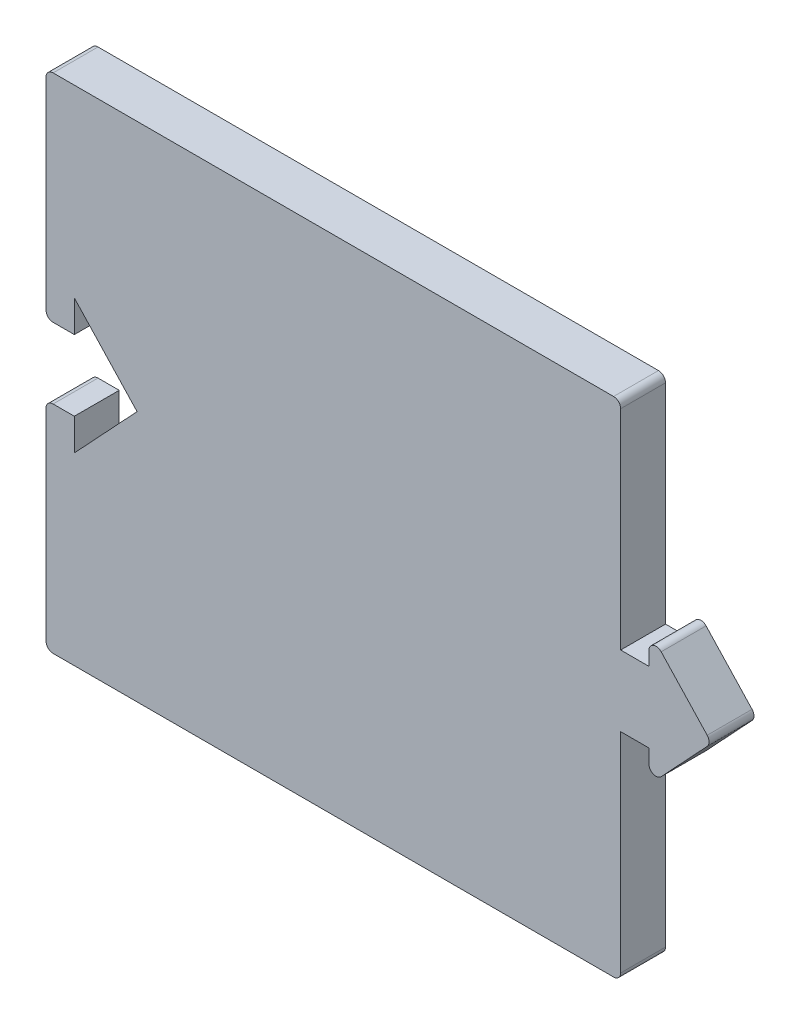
ISO-10303-21;
HEADER;
FILE_DESCRIPTION(('STEP AP214'),'2;1');
FILE_NAME('part.step','',(''),(''),'','','');
FILE_SCHEMA(('AUTOMOTIVE_DESIGN { 1 0 10303 214 1 1 1 1 }'));
ENDSEC;
DATA;
#1=APPLICATION_CONTEXT('core data for automotive mechanical design processes');
#2=APPLICATION_PROTOCOL_DEFINITION('international standard','automotive_design',2000,#1);
#3=PRODUCT_CONTEXT('',#1,'mechanical');
#4=PRODUCT('Part','Part','',(#3));
#5=PRODUCT_RELATED_PRODUCT_CATEGORY('part','',(#4));
#6=PRODUCT_DEFINITION_FORMATION('','',#4);
#7=PRODUCT_DEFINITION_CONTEXT('part definition',#1,'design');
#8=PRODUCT_DEFINITION('design','',#6,#7);
#9=PRODUCT_DEFINITION_SHAPE('','',#8);
#10=(LENGTH_UNIT() NAMED_UNIT(*) SI_UNIT(.MILLI.,.METRE.));
#11=(NAMED_UNIT(*) PLANE_ANGLE_UNIT() SI_UNIT($,.RADIAN.));
#12=(NAMED_UNIT(*) SI_UNIT($,.STERADIAN.) SOLID_ANGLE_UNIT());
#13=UNCERTAINTY_MEASURE_WITH_UNIT(LENGTH_MEASURE(1.E-05),#10,'distance_accuracy_value','');
#14=(GEOMETRIC_REPRESENTATION_CONTEXT(3) GLOBAL_UNCERTAINTY_ASSIGNED_CONTEXT((#13)) GLOBAL_UNIT_ASSIGNED_CONTEXT((#10,
#11,#12)) REPRESENTATION_CONTEXT('',''));
#15=CARTESIAN_POINT('',(0.,0.,0.));
#16=DIRECTION('',(0.,0.,1.));
#17=DIRECTION('',(1.,0.,0.));
#18=AXIS2_PLACEMENT_3D('',#15,#16,#17);
#19=CARTESIAN_POINT('',(0.,15.28,3.175));
#20=DIRECTION('',(1.,0.,0.));
#21=DIRECTION('',(0.,0.,-1.));
#22=AXIS2_PLACEMENT_3D('',#19,#20,#21);
#23=PLANE('',#22);
#24=DIRECTION('',(0.,-1.,0.));
#25=VECTOR('',#24,1.);
#26=CARTESIAN_POINT('',(0.,15.28,0.));
#27=LINE('',#26,#25);
#28=CARTESIAN_POINT('',(0.,14.78,0.));
#29=VERTEX_POINT('',#28);
#30=CARTESIAN_POINT('',(0.,0.5,0.));
#31=VERTEX_POINT('',#30);
#32=EDGE_CURVE('E276',#29,#31,#27,.T.);
#33=ORIENTED_EDGE('',*,*,#32,.T.);
#34=DIRECTION('',(0.,0.,-1.));
#35=VECTOR('',#34,1.);
#36=CARTESIAN_POINT('',(0.,0.5,3.175));
#37=LINE('',#36,#35);
#38=CARTESIAN_POINT('',(0.,0.5,3.175));
#39=VERTEX_POINT('',#38);
#40=EDGE_CURVE('E399',#31,#39,#37,.F.);
#41=ORIENTED_EDGE('',*,*,#40,.T.);
#42=DIRECTION('',(0.,-1.,0.));
#43=VECTOR('',#42,1.);
#44=CARTESIAN_POINT('',(0.,15.28,3.175));
#45=LINE('',#44,#43);
#46=CARTESIAN_POINT('',(0.,14.78,3.175));
#47=VERTEX_POINT('',#46);
#48=EDGE_CURVE('E319',#47,#39,#45,.T.);
#49=ORIENTED_EDGE('',*,*,#48,.F.);
#50=DIRECTION('',(0.,0.,-1.));
#51=VECTOR('',#50,1.);
#52=CARTESIAN_POINT('',(0.,14.78,3.175));
#53=LINE('',#52,#51);
#54=EDGE_CURVE('E396',#47,#29,#53,.T.);
#55=ORIENTED_EDGE('',*,*,#54,.T.);
#56=EDGE_LOOP('',(#33,#41,#49,#55));
#57=FACE_BOUND('',#56,.T.);
#58=ADVANCED_FACE('F33',(#57),#23,.F.);
#59=CARTESIAN_POINT('',(0.,0.,3.175));
#60=DIRECTION('',(0.,1.,0.));
#61=DIRECTION('',(-1.,0.,0.));
#62=AXIS2_PLACEMENT_3D('',#59,#60,#61);
#63=PLANE('',#62);
#64=DIRECTION('',(1.,0.,0.));
#65=VECTOR('',#64,1.);
#66=CARTESIAN_POINT('',(0.,0.,0.));
#67=LINE('',#66,#65);
#68=CARTESIAN_POINT('',(0.5,0.,0.));
#69=VERTEX_POINT('',#68);
#70=CARTESIAN_POINT('',(40.14,0.,0.));
#71=VERTEX_POINT('',#70);
#72=EDGE_CURVE('E279',#69,#71,#67,.T.);
#73=ORIENTED_EDGE('',*,*,#72,.T.);
#74=DIRECTION('',(0.,0.,-1.));
#75=VECTOR('',#74,1.);
#76=CARTESIAN_POINT('',(40.14,0.,3.175));
#77=LINE('',#76,#75);
#78=CARTESIAN_POINT('',(40.14,0.,3.175));
#79=VERTEX_POINT('',#78);
#80=EDGE_CURVE('E394',#71,#79,#77,.F.);
#81=ORIENTED_EDGE('',*,*,#80,.T.);
#82=DIRECTION('',(1.,0.,0.));
#83=VECTOR('',#82,1.);
#84=CARTESIAN_POINT('',(0.,0.,3.175));
#85=LINE('',#84,#83);
#86=CARTESIAN_POINT('',(0.5,0.,3.175));
#87=VERTEX_POINT('',#86);
#88=EDGE_CURVE('E225',#87,#79,#85,.T.);
#89=ORIENTED_EDGE('',*,*,#88,.F.);
#90=DIRECTION('',(0.,0.,-1.));
#91=VECTOR('',#90,1.);
#92=CARTESIAN_POINT('',(0.5,0.,3.175));
#93=LINE('',#92,#91);
#94=EDGE_CURVE('E391',#87,#69,#93,.T.);
#95=ORIENTED_EDGE('',*,*,#94,.T.);
#96=EDGE_LOOP('',(#73,#81,#89,#95));
#97=FACE_BOUND('',#96,.T.);
#98=ADVANCED_FACE('F477',(#97),#63,.F.);
#99=CARTESIAN_POINT('',(40.64,15.28,3.175));
#100=DIRECTION('',(-1.,0.,0.));
#101=DIRECTION('',(0.,-1.,0.));
#102=AXIS2_PLACEMENT_3D('',#99,#100,#101);
#103=PLANE('',#102);
#104=DIRECTION('',(0.,1.,0.));
#105=VECTOR('',#104,1.);
#106=CARTESIAN_POINT('',(40.64,15.28,3.175));
#107=LINE('',#106,#105);
#108=CARTESIAN_POINT('',(40.64,0.499999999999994,3.175));
#109=VERTEX_POINT('',#108);
#110=CARTESIAN_POINT('',(40.64,15.28,3.175));
#111=VERTEX_POINT('',#110);
#112=EDGE_CURVE('E212',#109,#111,#107,.T.);
#113=ORIENTED_EDGE('',*,*,#112,.F.);
#114=DIRECTION('',(0.,0.,-1.));
#115=VECTOR('',#114,1.);
#116=CARTESIAN_POINT('',(40.64,0.499999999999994,3.175));
#117=LINE('',#116,#115);
#118=CARTESIAN_POINT('',(40.64,0.499999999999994,0.));
#119=VERTEX_POINT('',#118);
#120=EDGE_CURVE('E389',#109,#119,#117,.T.);
#121=ORIENTED_EDGE('',*,*,#120,.T.);
#122=DIRECTION('',(0.,1.,0.));
#123=VECTOR('',#122,1.);
#124=CARTESIAN_POINT('',(40.64,15.28,0.));
#125=LINE('',#124,#123);
#126=CARTESIAN_POINT('',(40.64,15.28,0.));
#127=VERTEX_POINT('',#126);
#128=EDGE_CURVE('E231',#119,#127,#125,.T.);
#129=ORIENTED_EDGE('',*,*,#128,.T.);
#130=DIRECTION('',(0.,0.,-1.));
#131=VECTOR('',#130,1.);
#132=CARTESIAN_POINT('',(40.64,15.28,3.175));
#133=LINE('',#132,#131);
#134=EDGE_CURVE('E228',#111,#127,#133,.T.);
#135=ORIENTED_EDGE('',*,*,#134,.F.);
#136=EDGE_LOOP('',(#113,#121,#129,#135));
#137=FACE_BOUND('',#136,.T.);
#138=ADVANCED_FACE('F229',(#137),#103,.F.);
#139=CARTESIAN_POINT('',(40.64,15.28,3.175));
#140=DIRECTION('',(0.,1.,0.));
#141=DIRECTION('',(0.,0.,1.));
#142=AXIS2_PLACEMENT_3D('',#139,#140,#141);
#143=PLANE('',#142);
#144=DIRECTION('',(1.,0.,0.));
#145=VECTOR('',#144,1.);
#146=CARTESIAN_POINT('',(40.64,15.28,0.));
#147=LINE('',#146,#145);
#148=CARTESIAN_POINT('',(42.64,15.28,0.));
#149=VERTEX_POINT('',#148);
#150=EDGE_CURVE('E283',#127,#149,#147,.T.);
#151=ORIENTED_EDGE('',*,*,#150,.T.);
#152=DIRECTION('',(0.,0.,-1.));
#153=VECTOR('',#152,1.);
#154=CARTESIAN_POINT('',(42.64,15.28,3.175));
#155=LINE('',#154,#153);
#156=CARTESIAN_POINT('',(42.64,15.28,3.175));
#157=VERTEX_POINT('',#156);
#158=EDGE_CURVE('E235',#157,#149,#155,.T.);
#159=ORIENTED_EDGE('',*,*,#158,.F.);
#160=DIRECTION('',(1.,0.,0.));
#161=VECTOR('',#160,1.);
#162=CARTESIAN_POINT('',(40.64,15.28,3.175));
#163=LINE('',#162,#161);
#164=EDGE_CURVE('E217',#111,#157,#163,.T.);
#165=ORIENTED_EDGE('',*,*,#164,.F.);
#166=ORIENTED_EDGE('',*,*,#134,.T.);
#167=EDGE_LOOP('',(#151,#159,#165,#166));
#168=FACE_BOUND('',#167,.T.);
#169=ADVANCED_FACE('F237',(#168),#143,.F.);
#170=CARTESIAN_POINT('',(42.64,15.28,3.175));
#171=DIRECTION('',(1.,0.,0.));
#172=DIRECTION('',(0.,0.,-1.));
#173=AXIS2_PLACEMENT_3D('',#170,#171,#172);
#174=PLANE('',#173);
#175=DIRECTION('',(0.,-1.,0.));
#176=VECTOR('',#175,1.);
#177=CARTESIAN_POINT('',(42.64,15.28,0.));
#178=LINE('',#177,#176);
#179=CARTESIAN_POINT('',(42.64,14.2977313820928,0.));
#180=VERTEX_POINT('',#179);
#181=EDGE_CURVE('E285',#149,#180,#178,.T.);
#182=ORIENTED_EDGE('',*,*,#181,.T.);
#183=DIRECTION('',(0.,0.,-1.));
#184=VECTOR('',#183,1.);
#185=CARTESIAN_POINT('',(42.64,14.2977313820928,3.175));
#186=LINE('',#185,#184);
#187=CARTESIAN_POINT('',(42.64,14.2977313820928,3.175));
#188=VERTEX_POINT('',#187);
#189=EDGE_CURVE('E363',#180,#188,#186,.F.);
#190=ORIENTED_EDGE('',*,*,#189,.T.);
#191=DIRECTION('',(0.,-1.,0.));
#192=VECTOR('',#191,1.);
#193=CARTESIAN_POINT('',(42.64,15.28,3.175));
#194=LINE('',#193,#192);
#195=EDGE_CURVE('E240',#157,#188,#194,.T.);
#196=ORIENTED_EDGE('',*,*,#195,.F.);
#197=ORIENTED_EDGE('',*,*,#158,.T.);
#198=EDGE_LOOP('',(#182,#190,#196,#197));
#199=FACE_BOUND('',#198,.T.);
#200=ADVANCED_FACE('F484',(#199),#174,.F.);
#201=CARTESIAN_POINT('',(42.64,13.03,3.175));
#202=DIRECTION('',(-0.73076923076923,0.682624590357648,0.));
#203=DIRECTION('',(-0.682624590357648,-0.730769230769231,0.));
#204=AXIS2_PLACEMENT_3D('',#201,#202,#203);
#205=PLANE('',#204);
#206=DIRECTION('',(0.682624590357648,0.73076923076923,0.));
#207=VECTOR('',#206,1.);
#208=CARTESIAN_POINT('',(42.64,13.03,3.175));
#209=LINE('',#208,#207);
#210=CARTESIAN_POINT('',(43.5053846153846,13.956419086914,3.175));
#211=VERTEX_POINT('',#210);
#212=CARTESIAN_POINT('',(46.7582339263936,17.4386877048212,3.175));
#213=VERTEX_POINT('',#212);
#214=EDGE_CURVE('E242',#211,#213,#209,.T.);
#215=ORIENTED_EDGE('',*,*,#214,.F.);
#216=DIRECTION('',(0.,0.,-1.));
#217=VECTOR('',#216,1.);
#218=CARTESIAN_POINT('',(43.5053846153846,13.956419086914,3.175));
#219=LINE('',#218,#217);
#220=CARTESIAN_POINT('',(43.5053846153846,13.956419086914,0.));
#221=VERTEX_POINT('',#220);
#222=EDGE_CURVE('E342',#211,#221,#219,.T.);
#223=ORIENTED_EDGE('',*,*,#222,.T.);
#224=DIRECTION('',(0.682624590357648,0.73076923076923,0.));
#225=VECTOR('',#224,1.);
#226=CARTESIAN_POINT('',(42.64,13.03,0.));
#227=LINE('',#226,#225);
#228=CARTESIAN_POINT('',(46.7582339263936,17.4386877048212,0.));
#229=VERTEX_POINT('',#228);
#230=EDGE_CURVE('E288',#221,#229,#227,.T.);
#231=ORIENTED_EDGE('',*,*,#230,.T.);
#232=DIRECTION('',(0.,0.,-1.));
#233=VECTOR('',#232,1.);
#234=CARTESIAN_POINT('',(46.7582339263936,17.4386877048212,3.175));
#235=LINE('',#234,#233);
#236=EDGE_CURVE('E234',#229,#213,#235,.F.);
#237=ORIENTED_EDGE('',*,*,#236,.T.);
#238=EDGE_LOOP('',(#215,#223,#231,#237));
#239=FACE_BOUND('',#238,.T.);
#240=ADVANCED_FACE('F492',(#239),#205,.F.);
#241=CARTESIAN_POINT('',(42.64,22.53,3.175));
#242=DIRECTION('',(-0.73076923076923,-0.682624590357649,0.));
#243=DIRECTION('',(0.682624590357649,-0.73076923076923,0.));
#244=AXIS2_PLACEMENT_3D('',#241,#242,#243);
#245=PLANE('',#244);
#246=DIRECTION('',(-0.682624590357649,0.73076923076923,0.));
#247=VECTOR('',#246,1.);
#248=CARTESIAN_POINT('',(42.64,22.53,0.));
#249=LINE('',#248,#247);
#250=CARTESIAN_POINT('',(46.7582339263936,18.1213122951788,0.));
#251=VERTEX_POINT('',#250);
#252=CARTESIAN_POINT('',(43.5053846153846,21.603580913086,0.));
#253=VERTEX_POINT('',#252);
#254=EDGE_CURVE('E291',#251,#253,#249,.T.);
#255=ORIENTED_EDGE('',*,*,#254,.T.);
#256=DIRECTION('',(0.,0.,-1.));
#257=VECTOR('',#256,1.);
#258=CARTESIAN_POINT('',(43.5053846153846,21.603580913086,3.175));
#259=LINE('',#258,#257);
#260=CARTESIAN_POINT('',(43.5053846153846,21.603580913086,3.175));
#261=VERTEX_POINT('',#260);
#262=EDGE_CURVE('E387',#253,#261,#259,.F.);
#263=ORIENTED_EDGE('',*,*,#262,.T.);
#264=DIRECTION('',(-0.682624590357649,0.73076923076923,0.));
#265=VECTOR('',#264,1.);
#266=CARTESIAN_POINT('',(42.64,22.53,3.175));
#267=LINE('',#266,#265);
#268=CARTESIAN_POINT('',(46.7582339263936,18.1213122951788,3.175));
#269=VERTEX_POINT('',#268);
#270=EDGE_CURVE('E248',#269,#261,#267,.T.);
#271=ORIENTED_EDGE('',*,*,#270,.F.);
#272=DIRECTION('',(0.,0.,-1.));
#273=VECTOR('',#272,1.);
#274=CARTESIAN_POINT('',(46.7582339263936,18.1213122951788,3.175));
#275=LINE('',#274,#273);
#276=EDGE_CURVE('E384',#269,#251,#275,.T.);
#277=ORIENTED_EDGE('',*,*,#276,.T.);
#278=EDGE_LOOP('',(#255,#263,#271,#277));
#279=FACE_BOUND('',#278,.T.);
#280=ADVANCED_FACE('F501',(#279),#245,.F.);
#281=CARTESIAN_POINT('',(42.64,20.28,3.175));
#282=DIRECTION('',(1.,0.,0.));
#283=DIRECTION('',(0.,0.,-1.));
#284=AXIS2_PLACEMENT_3D('',#281,#282,#283);
#285=PLANE('',#284);
#286=DIRECTION('',(0.,-1.,0.));
#287=VECTOR('',#286,1.);
#288=CARTESIAN_POINT('',(42.64,20.28,3.175));
#289=LINE('',#288,#287);
#290=CARTESIAN_POINT('',(42.64,21.2622686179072,3.175));
#291=VERTEX_POINT('',#290);
#292=CARTESIAN_POINT('',(42.64,20.28,3.175));
#293=VERTEX_POINT('',#292);
#294=EDGE_CURVE('E251',#291,#293,#289,.T.);
#295=ORIENTED_EDGE('',*,*,#294,.F.);
#296=DIRECTION('',(0.,0.,-1.));
#297=VECTOR('',#296,1.);
#298=CARTESIAN_POINT('',(42.64,21.2622686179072,3.175));
#299=LINE('',#298,#297);
#300=CARTESIAN_POINT('',(42.64,21.2622686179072,0.));
#301=VERTEX_POINT('',#300);
#302=EDGE_CURVE('E381',#291,#301,#299,.T.);
#303=ORIENTED_EDGE('',*,*,#302,.T.);
#304=DIRECTION('',(0.,-1.,0.));
#305=VECTOR('',#304,1.);
#306=CARTESIAN_POINT('',(42.64,20.28,0.));
#307=LINE('',#306,#305);
#308=CARTESIAN_POINT('',(42.64,20.28,0.));
#309=VERTEX_POINT('',#308);
#310=EDGE_CURVE('E294',#301,#309,#307,.T.);
#311=ORIENTED_EDGE('',*,*,#310,.T.);
#312=DIRECTION('',(0.,0.,-1.));
#313=VECTOR('',#312,1.);
#314=CARTESIAN_POINT('',(42.64,20.28,3.175));
#315=LINE('',#314,#313);
#316=EDGE_CURVE('E337',#293,#309,#315,.T.);
#317=ORIENTED_EDGE('',*,*,#316,.F.);
#318=EDGE_LOOP('',(#295,#303,#311,#317));
#319=FACE_BOUND('',#318,.T.);
#320=ADVANCED_FACE('F510',(#319),#285,.F.);
#321=CARTESIAN_POINT('',(40.64,20.28,3.175));
#322=DIRECTION('',(0.,-1.,0.));
#323=DIRECTION('',(0.,0.,-1.));
#324=AXIS2_PLACEMENT_3D('',#321,#322,#323);
#325=PLANE('',#324);
#326=DIRECTION('',(-1.,0.,0.));
#327=VECTOR('',#326,1.);
#328=CARTESIAN_POINT('',(40.64,20.28,0.));
#329=LINE('',#328,#327);
#330=CARTESIAN_POINT('',(40.64,20.28,0.));
#331=VERTEX_POINT('',#330);
#332=EDGE_CURVE('E296',#309,#331,#329,.T.);
#333=ORIENTED_EDGE('',*,*,#332,.T.);
#334=DIRECTION('',(0.,0.,-1.));
#335=VECTOR('',#334,1.);
#336=CARTESIAN_POINT('',(40.64,20.28,3.175));
#337=LINE('',#336,#335);
#338=CARTESIAN_POINT('',(40.64,20.28,3.175));
#339=VERTEX_POINT('',#338);
#340=EDGE_CURVE('E334',#339,#331,#337,.T.);
#341=ORIENTED_EDGE('',*,*,#340,.F.);
#342=DIRECTION('',(-1.,0.,0.));
#343=VECTOR('',#342,1.);
#344=CARTESIAN_POINT('',(40.64,20.28,3.175));
#345=LINE('',#344,#343);
#346=EDGE_CURVE('E253',#293,#339,#345,.T.);
#347=ORIENTED_EDGE('',*,*,#346,.F.);
#348=ORIENTED_EDGE('',*,*,#316,.T.);
#349=EDGE_LOOP('',(#333,#341,#347,#348));
#350=FACE_BOUND('',#349,.T.);
#351=ADVANCED_FACE('F515',(#350),#325,.F.);
#352=CARTESIAN_POINT('',(40.64,35.56,3.175));
#353=DIRECTION('',(-1.,0.,0.));
#354=DIRECTION('',(0.,-1.,0.));
#355=AXIS2_PLACEMENT_3D('',#352,#353,#354);
#356=PLANE('',#355);
#357=DIRECTION('',(0.,1.,0.));
#358=VECTOR('',#357,1.);
#359=CARTESIAN_POINT('',(40.64,35.56,0.));
#360=LINE('',#359,#358);
#361=CARTESIAN_POINT('',(40.64,35.06,0.));
#362=VERTEX_POINT('',#361);
#363=EDGE_CURVE('E298',#331,#362,#360,.T.);
#364=ORIENTED_EDGE('',*,*,#363,.T.);
#365=DIRECTION('',(0.,0.,-1.));
#366=VECTOR('',#365,1.);
#367=CARTESIAN_POINT('',(40.64,35.06,3.175));
#368=LINE('',#367,#366);
#369=CARTESIAN_POINT('',(40.64,35.06,3.175));
#370=VERTEX_POINT('',#369);
#371=EDGE_CURVE('E11',#362,#370,#368,.F.);
#372=ORIENTED_EDGE('',*,*,#371,.T.);
#373=DIRECTION('',(0.,1.,0.));
#374=VECTOR('',#373,1.);
#375=CARTESIAN_POINT('',(40.64,35.56,3.175));
#376=LINE('',#375,#374);
#377=EDGE_CURVE('E255',#339,#370,#376,.T.);
#378=ORIENTED_EDGE('',*,*,#377,.F.);
#379=ORIENTED_EDGE('',*,*,#340,.T.);
#380=EDGE_LOOP('',(#364,#372,#378,#379));
#381=FACE_BOUND('',#380,.T.);
#382=ADVANCED_FACE('F519',(#381),#356,.F.);
#383=CARTESIAN_POINT('',(0.,35.56,3.175));
#384=DIRECTION('',(0.,-1.,0.));
#385=DIRECTION('',(1.,0.,0.));
#386=AXIS2_PLACEMENT_3D('',#383,#384,#385);
#387=PLANE('',#386);
#388=DIRECTION('',(-1.,0.,0.));
#389=VECTOR('',#388,1.);
#390=CARTESIAN_POINT('',(0.,35.56,3.175));
#391=LINE('',#390,#389);
#392=CARTESIAN_POINT('',(40.14,35.56,3.175));
#393=VERTEX_POINT('',#392);
#394=CARTESIAN_POINT('',(0.5,35.56,3.175));
#395=VERTEX_POINT('',#394);
#396=EDGE_CURVE('E258',#393,#395,#391,.T.);
#397=ORIENTED_EDGE('',*,*,#396,.F.);
#398=DIRECTION('',(0.,0.,-1.));
#399=VECTOR('',#398,1.);
#400=CARTESIAN_POINT('',(40.14,35.56,3.175));
#401=LINE('',#400,#399);
#402=CARTESIAN_POINT('',(40.14,35.56,0.));
#403=VERTEX_POINT('',#402);
#404=EDGE_CURVE('E41',#393,#403,#401,.T.);
#405=ORIENTED_EDGE('',*,*,#404,.T.);
#406=DIRECTION('',(-1.,0.,0.));
#407=VECTOR('',#406,1.);
#408=CARTESIAN_POINT('',(0.,35.56,0.));
#409=LINE('',#408,#407);
#410=CARTESIAN_POINT('',(0.5,35.56,0.));
#411=VERTEX_POINT('',#410);
#412=EDGE_CURVE('E301',#403,#411,#409,.T.);
#413=ORIENTED_EDGE('',*,*,#412,.T.);
#414=DIRECTION('',(0.,0.,-1.));
#415=VECTOR('',#414,1.);
#416=CARTESIAN_POINT('',(0.5,35.56,3.175));
#417=LINE('',#416,#415);
#418=EDGE_CURVE('E410',#411,#395,#417,.F.);
#419=ORIENTED_EDGE('',*,*,#418,.T.);
#420=EDGE_LOOP('',(#397,#405,#413,#419));
#421=FACE_BOUND('',#420,.T.);
#422=ADVANCED_FACE('F416',(#421),#387,.F.);
#423=CARTESIAN_POINT('',(0.,35.56,3.175));
#424=DIRECTION('',(1.,0.,0.));
#425=DIRECTION('',(0.,0.,-1.));
#426=AXIS2_PLACEMENT_3D('',#423,#424,#425);
#427=PLANE('',#426);
#428=DIRECTION('',(0.,-1.,0.));
#429=VECTOR('',#428,1.);
#430=CARTESIAN_POINT('',(0.,35.56,0.));
#431=LINE('',#430,#429);
#432=CARTESIAN_POINT('',(0.,35.06,0.));
#433=VERTEX_POINT('',#432);
#434=CARTESIAN_POINT('',(0.,20.78,0.));
#435=VERTEX_POINT('',#434);
#436=EDGE_CURVE('E304',#433,#435,#431,.T.);
#437=ORIENTED_EDGE('',*,*,#436,.T.);
#438=DIRECTION('',(0.,0.,-1.));
#439=VECTOR('',#438,1.);
#440=CARTESIAN_POINT('',(0.,20.78,3.175));
#441=LINE('',#440,#439);
#442=CARTESIAN_POINT('',(0.,20.78,3.175));
#443=VERTEX_POINT('',#442);
#444=EDGE_CURVE('E408',#435,#443,#441,.F.);
#445=ORIENTED_EDGE('',*,*,#444,.T.);
#446=DIRECTION('',(0.,-1.,0.));
#447=VECTOR('',#446,1.);
#448=CARTESIAN_POINT('',(0.,35.56,3.175));
#449=LINE('',#448,#447);
#450=CARTESIAN_POINT('',(0.,35.06,3.175));
#451=VERTEX_POINT('',#450);
#452=EDGE_CURVE('E261',#451,#443,#449,.T.);
#453=ORIENTED_EDGE('',*,*,#452,.F.);
#454=DIRECTION('',(0.,0.,-1.));
#455=VECTOR('',#454,1.);
#456=CARTESIAN_POINT('',(0.,35.06,3.175));
#457=LINE('',#456,#455);
#458=EDGE_CURVE('E405',#451,#433,#457,.T.);
#459=ORIENTED_EDGE('',*,*,#458,.T.);
#460=EDGE_LOOP('',(#437,#445,#453,#459));
#461=FACE_BOUND('',#460,.T.);
#462=ADVANCED_FACE('F430',(#461),#427,.F.);
#463=CARTESIAN_POINT('',(0.,20.28,3.175));
#464=DIRECTION('',(0.,1.,0.));
#465=DIRECTION('',(-1.,0.,0.));
#466=AXIS2_PLACEMENT_3D('',#463,#464,#465);
#467=PLANE('',#466);
#468=DIRECTION('',(1.,0.,0.));
#469=VECTOR('',#468,1.);
#470=CARTESIAN_POINT('',(0.,20.28,3.175));
#471=LINE('',#470,#469);
#472=CARTESIAN_POINT('',(0.500000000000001,20.28,3.175));
#473=VERTEX_POINT('',#472);
#474=CARTESIAN_POINT('',(2.,20.28,3.175));
#475=VERTEX_POINT('',#474);
#476=EDGE_CURVE('E263',#473,#475,#471,.T.);
#477=ORIENTED_EDGE('',*,*,#476,.F.);
#478=DIRECTION('',(0.,0.,-1.));
#479=VECTOR('',#478,1.);
#480=CARTESIAN_POINT('',(0.500000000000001,20.28,3.175));
#481=LINE('',#480,#479);
#482=CARTESIAN_POINT('',(0.500000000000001,20.28,0.));
#483=VERTEX_POINT('',#482);
#484=EDGE_CURVE('E402',#473,#483,#481,.T.);
#485=ORIENTED_EDGE('',*,*,#484,.T.);
#486=DIRECTION('',(1.,0.,0.));
#487=VECTOR('',#486,1.);
#488=CARTESIAN_POINT('',(0.,20.28,0.));
#489=LINE('',#488,#487);
#490=CARTESIAN_POINT('',(2.,20.28,0.));
#491=VERTEX_POINT('',#490);
#492=EDGE_CURVE('E307',#483,#491,#489,.T.);
#493=ORIENTED_EDGE('',*,*,#492,.T.);
#494=DIRECTION('',(0.,0.,-1.));
#495=VECTOR('',#494,1.);
#496=CARTESIAN_POINT('',(2.,20.28,3.175));
#497=LINE('',#496,#495);
#498=EDGE_CURVE('E331',#475,#491,#497,.T.);
#499=ORIENTED_EDGE('',*,*,#498,.F.);
#500=EDGE_LOOP('',(#477,#485,#493,#499));
#501=FACE_BOUND('',#500,.T.);
#502=ADVANCED_FACE('F437',(#501),#467,.F.);
#503=CARTESIAN_POINT('',(2.,20.28,3.175));
#504=DIRECTION('',(-1.,0.,0.));
#505=DIRECTION('',(0.,0.,1.));
#506=AXIS2_PLACEMENT_3D('',#503,#504,#505);
#507=PLANE('',#506);
#508=DIRECTION('',(0.,1.,0.));
#509=VECTOR('',#508,1.);
#510=CARTESIAN_POINT('',(2.,20.28,0.));
#511=LINE('',#510,#509);
#512=CARTESIAN_POINT('',(2.,22.53,0.));
#513=VERTEX_POINT('',#512);
#514=EDGE_CURVE('E309',#491,#513,#511,.T.);
#515=ORIENTED_EDGE('',*,*,#514,.T.);
#516=DIRECTION('',(0.,0.,-1.));
#517=VECTOR('',#516,1.);
#518=CARTESIAN_POINT('',(2.,22.53,3.175));
#519=LINE('',#518,#517);
#520=CARTESIAN_POINT('',(2.,22.53,3.175));
#521=VERTEX_POINT('',#520);
#522=EDGE_CURVE('E328',#521,#513,#519,.T.);
#523=ORIENTED_EDGE('',*,*,#522,.F.);
#524=DIRECTION('',(0.,1.,0.));
#525=VECTOR('',#524,1.);
#526=CARTESIAN_POINT('',(2.,20.28,3.175));
#527=LINE('',#526,#525);
#528=EDGE_CURVE('E265',#475,#521,#527,.T.);
#529=ORIENTED_EDGE('',*,*,#528,.F.);
#530=ORIENTED_EDGE('',*,*,#498,.T.);
#531=EDGE_LOOP('',(#515,#523,#529,#530));
#532=FACE_BOUND('',#531,.T.);
#533=ADVANCED_FACE('F444',(#532),#507,.F.);
#534=CARTESIAN_POINT('',(2.,22.53,3.175));
#535=DIRECTION('',(0.730769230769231,0.682624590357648,0.));
#536=DIRECTION('',(-0.682624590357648,0.730769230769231,0.));
#537=AXIS2_PLACEMENT_3D('',#534,#535,#536);
#538=PLANE('',#537);
#539=DIRECTION('',(0.682624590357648,-0.730769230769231,0.));
#540=VECTOR('',#539,1.);
#541=CARTESIAN_POINT('',(2.,22.53,0.));
#542=LINE('',#541,#540);
#543=CARTESIAN_POINT('',(6.43705983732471,17.78,0.));
#544=VERTEX_POINT('',#543);
#545=EDGE_CURVE('E311',#513,#544,#542,.T.);
#546=ORIENTED_EDGE('',*,*,#545,.T.);
#547=DIRECTION('',(0.,0.,-1.));
#548=VECTOR('',#547,1.);
#549=CARTESIAN_POINT('',(6.43705983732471,17.78,3.175));
#550=LINE('',#549,#548);
#551=CARTESIAN_POINT('',(6.43705983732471,17.78,3.175));
#552=VERTEX_POINT('',#551);
#553=EDGE_CURVE('E325',#552,#544,#550,.T.);
#554=ORIENTED_EDGE('',*,*,#553,.F.);
#555=DIRECTION('',(0.682624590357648,-0.730769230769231,0.));
#556=VECTOR('',#555,1.);
#557=CARTESIAN_POINT('',(2.,22.53,3.175));
#558=LINE('',#557,#556);
#559=EDGE_CURVE('E267',#521,#552,#558,.T.);
#560=ORIENTED_EDGE('',*,*,#559,.F.);
#561=ORIENTED_EDGE('',*,*,#522,.T.);
#562=EDGE_LOOP('',(#546,#554,#560,#561));
#563=FACE_BOUND('',#562,.T.);
#564=ADVANCED_FACE('F448',(#563),#538,.F.);
#565=CARTESIAN_POINT('',(2.,13.03,3.175));
#566=DIRECTION('',(0.730769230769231,-0.682624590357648,0.));
#567=DIRECTION('',(0.682624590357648,0.730769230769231,0.));
#568=AXIS2_PLACEMENT_3D('',#565,#566,#567);
#569=PLANE('',#568);
#570=DIRECTION('',(-0.682624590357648,-0.730769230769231,0.));
#571=VECTOR('',#570,1.);
#572=CARTESIAN_POINT('',(2.,13.03,0.));
#573=LINE('',#572,#571);
#574=CARTESIAN_POINT('',(2.,13.03,0.));
#575=VERTEX_POINT('',#574);
#576=EDGE_CURVE('E313',#544,#575,#573,.T.);
#577=ORIENTED_EDGE('',*,*,#576,.T.);
#578=DIRECTION('',(0.,0.,-1.));
#579=VECTOR('',#578,1.);
#580=CARTESIAN_POINT('',(2.,13.03,3.175));
#581=LINE('',#580,#579);
#582=CARTESIAN_POINT('',(2.,13.03,3.175));
#583=VERTEX_POINT('',#582);
#584=EDGE_CURVE('E322',#583,#575,#581,.T.);
#585=ORIENTED_EDGE('',*,*,#584,.F.);
#586=DIRECTION('',(-0.682624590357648,-0.730769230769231,0.));
#587=VECTOR('',#586,1.);
#588=CARTESIAN_POINT('',(2.,13.03,3.175));
#589=LINE('',#588,#587);
#590=EDGE_CURVE('E269',#552,#583,#589,.T.);
#591=ORIENTED_EDGE('',*,*,#590,.F.);
#592=ORIENTED_EDGE('',*,*,#553,.T.);
#593=EDGE_LOOP('',(#577,#585,#591,#592));
#594=FACE_BOUND('',#593,.T.);
#595=ADVANCED_FACE('F455',(#594),#569,.F.);
#596=CARTESIAN_POINT('',(2.,15.28,3.175));
#597=DIRECTION('',(-1.,0.,0.));
#598=DIRECTION('',(0.,0.,1.));
#599=AXIS2_PLACEMENT_3D('',#596,#597,#598);
#600=PLANE('',#599);
#601=DIRECTION('',(0.,1.,0.));
#602=VECTOR('',#601,1.);
#603=CARTESIAN_POINT('',(2.,15.28,0.));
#604=LINE('',#603,#602);
#605=CARTESIAN_POINT('',(2.,15.28,0.));
#606=VERTEX_POINT('',#605);
#607=EDGE_CURVE('E315',#575,#606,#604,.T.);
#608=ORIENTED_EDGE('',*,*,#607,.T.);
#609=DIRECTION('',(0.,0.,-1.));
#610=VECTOR('',#609,1.);
#611=CARTESIAN_POINT('',(2.,15.28,3.175));
#612=LINE('',#611,#610);
#613=CARTESIAN_POINT('',(2.,15.28,3.175));
#614=VERTEX_POINT('',#613);
#615=EDGE_CURVE('E275',#614,#606,#612,.T.);
#616=ORIENTED_EDGE('',*,*,#615,.F.);
#617=DIRECTION('',(0.,1.,0.));
#618=VECTOR('',#617,1.);
#619=CARTESIAN_POINT('',(2.,15.28,3.175));
#620=LINE('',#619,#618);
#621=EDGE_CURVE('E271',#583,#614,#620,.T.);
#622=ORIENTED_EDGE('',*,*,#621,.F.);
#623=ORIENTED_EDGE('',*,*,#584,.T.);
#624=EDGE_LOOP('',(#608,#616,#622,#623));
#625=FACE_BOUND('',#624,.T.);
#626=ADVANCED_FACE('F458',(#625),#600,.F.);
#627=CARTESIAN_POINT('',(0.,15.28,3.175));
#628=DIRECTION('',(0.,-1.,0.));
#629=DIRECTION('',(1.,0.,0.));
#630=AXIS2_PLACEMENT_3D('',#627,#628,#629);
#631=PLANE('',#630);
#632=DIRECTION('',(-1.,0.,0.));
#633=VECTOR('',#632,1.);
#634=CARTESIAN_POINT('',(0.,15.28,0.));
#635=LINE('',#634,#633);
#636=CARTESIAN_POINT('',(0.500000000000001,15.28,0.));
#637=VERTEX_POINT('',#636);
#638=EDGE_CURVE('E317',#606,#637,#635,.T.);
#639=ORIENTED_EDGE('',*,*,#638,.T.);
#640=DIRECTION('',(0.,0.,-1.));
#641=VECTOR('',#640,1.);
#642=CARTESIAN_POINT('',(0.500000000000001,15.28,3.175));
#643=LINE('',#642,#641);
#644=CARTESIAN_POINT('',(0.500000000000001,15.28,3.175));
#645=VERTEX_POINT('',#644);
#646=EDGE_CURVE('E48',#637,#645,#643,.F.);
#647=ORIENTED_EDGE('',*,*,#646,.T.);
#648=DIRECTION('',(-1.,0.,0.));
#649=VECTOR('',#648,1.);
#650=CARTESIAN_POINT('',(0.,15.28,3.175));
#651=LINE('',#650,#649);
#652=EDGE_CURVE('E273',#614,#645,#651,.T.);
#653=ORIENTED_EDGE('',*,*,#652,.F.);
#654=ORIENTED_EDGE('',*,*,#615,.T.);
#655=EDGE_LOOP('',(#639,#647,#653,#654));
#656=FACE_BOUND('',#655,.T.);
#657=ADVANCED_FACE('F460',(#656),#631,.F.);
#658=CARTESIAN_POINT('',(0.,0.,3.175));
#659=DIRECTION('',(0.,0.,1.));
#660=DIRECTION('',(1.,0.,0.));
#661=AXIS2_PLACEMENT_3D('',#658,#659,#660);
#662=PLANE('',#661);
#663=ORIENTED_EDGE('',*,*,#195,.T.);
#664=CARTESIAN_POINT('',(43.14,14.2977313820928,3.175));
#665=DIRECTION('',(0.,0.,1.));
#666=DIRECTION('',(1.,0.,0.));
#667=AXIS2_PLACEMENT_3D('',#664,#665,#666);
#668=CIRCLE('',#667,0.5);
#669=EDGE_CURVE('E379',#188,#211,#668,.T.);
#670=ORIENTED_EDGE('',*,*,#669,.T.);
#671=ORIENTED_EDGE('',*,*,#214,.T.);
#672=CARTESIAN_POINT('',(46.3928493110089,17.78,3.175));
#673=DIRECTION('',(0.,0.,1.));
#674=DIRECTION('',(1.,0.,0.));
#675=AXIS2_PLACEMENT_3D('',#672,#673,#674);
#676=CIRCLE('',#675,0.5);
#677=EDGE_CURVE('E375',#213,#269,#676,.T.);
#678=ORIENTED_EDGE('',*,*,#677,.T.);
#679=ORIENTED_EDGE('',*,*,#270,.T.);
#680=CARTESIAN_POINT('',(43.14,21.2622686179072,3.175));
#681=DIRECTION('',(0.,0.,1.));
#682=DIRECTION('',(1.,0.,0.));
#683=AXIS2_PLACEMENT_3D('',#680,#681,#682);
#684=CIRCLE('',#683,0.5);
#685=EDGE_CURVE('E377',#261,#291,#684,.T.);
#686=ORIENTED_EDGE('',*,*,#685,.T.);
#687=ORIENTED_EDGE('',*,*,#294,.T.);
#688=ORIENTED_EDGE('',*,*,#346,.T.);
#689=ORIENTED_EDGE('',*,*,#377,.T.);
#690=CARTESIAN_POINT('',(40.14,35.06,3.175));
#691=DIRECTION('',(0.,0.,1.));
#692=DIRECTION('',(1.,0.,0.));
#693=AXIS2_PLACEMENT_3D('',#690,#691,#692);
#694=CIRCLE('',#693,0.5);
#695=EDGE_CURVE('E367',#370,#393,#694,.T.);
#696=ORIENTED_EDGE('',*,*,#695,.T.);
#697=ORIENTED_EDGE('',*,*,#396,.T.);
#698=CARTESIAN_POINT('',(0.5,35.06,3.175));
#699=DIRECTION('',(0.,0.,1.));
#700=DIRECTION('',(1.,0.,0.));
#701=AXIS2_PLACEMENT_3D('',#698,#699,#700);
#702=CIRCLE('',#701,0.5);
#703=EDGE_CURVE('E365',#395,#451,#702,.T.);
#704=ORIENTED_EDGE('',*,*,#703,.T.);
#705=ORIENTED_EDGE('',*,*,#452,.T.);
#706=CARTESIAN_POINT('',(0.5,20.78,3.175));
#707=DIRECTION('',(0.,0.,1.));
#708=DIRECTION('',(1.,0.,0.));
#709=AXIS2_PLACEMENT_3D('',#706,#707,#708);
#710=CIRCLE('',#709,0.5);
#711=EDGE_CURVE('E56',#443,#473,#710,.T.);
#712=ORIENTED_EDGE('',*,*,#711,.T.);
#713=ORIENTED_EDGE('',*,*,#476,.T.);
#714=ORIENTED_EDGE('',*,*,#528,.T.);
#715=ORIENTED_EDGE('',*,*,#559,.T.);
#716=ORIENTED_EDGE('',*,*,#590,.T.);
#717=ORIENTED_EDGE('',*,*,#621,.T.);
#718=ORIENTED_EDGE('',*,*,#652,.T.);
#719=CARTESIAN_POINT('',(0.5,14.78,3.175));
#720=DIRECTION('',(0.,0.,1.));
#721=DIRECTION('',(1.,0.,0.));
#722=AXIS2_PLACEMENT_3D('',#719,#720,#721);
#723=CIRCLE('',#722,0.5);
#724=EDGE_CURVE('E370',#645,#47,#723,.T.);
#725=ORIENTED_EDGE('',*,*,#724,.T.);
#726=ORIENTED_EDGE('',*,*,#48,.T.);
#727=CARTESIAN_POINT('',(0.5,0.5,3.175));
#728=DIRECTION('',(0.,0.,1.));
#729=DIRECTION('',(1.,0.,0.));
#730=AXIS2_PLACEMENT_3D('',#727,#728,#729);
#731=CIRCLE('',#730,0.5);
#732=EDGE_CURVE('E372',#39,#87,#731,.T.);
#733=ORIENTED_EDGE('',*,*,#732,.T.);
#734=ORIENTED_EDGE('',*,*,#88,.T.);
#735=CARTESIAN_POINT('',(40.14,0.499999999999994,3.175));
#736=DIRECTION('',(0.,0.,1.));
#737=DIRECTION('',(1.,0.,0.));
#738=AXIS2_PLACEMENT_3D('',#735,#736,#737);
#739=CIRCLE('',#738,0.5);
#740=EDGE_CURVE('E221',#79,#109,#739,.T.);
#741=ORIENTED_EDGE('',*,*,#740,.T.);
#742=ORIENTED_EDGE('',*,*,#112,.T.);
#743=ORIENTED_EDGE('',*,*,#164,.T.);
#744=EDGE_LOOP('',(#663,#670,#671,#678,#679,#686,#687,#688,#689,#696,#697,#704,#705,#712,#713,
#714,#715,#716,#717,#718,#725,#726,#733,#734,#741,#742,#743));
#745=FACE_BOUND('',#744,.T.);
#746=ADVANCED_FACE('F215',(#745),#662,.T.);
#747=CARTESIAN_POINT('',(0.,0.,0.));
#748=DIRECTION('',(0.,0.,1.));
#749=DIRECTION('',(1.,0.,0.));
#750=AXIS2_PLACEMENT_3D('',#747,#748,#749);
#751=PLANE('',#750);
#752=ORIENTED_EDGE('',*,*,#230,.F.);
#753=CARTESIAN_POINT('',(43.14,14.2977313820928,0.));
#754=DIRECTION('',(0.,0.,1.));
#755=DIRECTION('',(1.,0.,0.));
#756=AXIS2_PLACEMENT_3D('',#753,#754,#755);
#757=CIRCLE('',#756,0.5);
#758=EDGE_CURVE('E361',#221,#180,#757,.F.);
#759=ORIENTED_EDGE('',*,*,#758,.T.);
#760=ORIENTED_EDGE('',*,*,#181,.F.);
#761=ORIENTED_EDGE('',*,*,#150,.F.);
#762=ORIENTED_EDGE('',*,*,#128,.F.);
#763=CARTESIAN_POINT('',(40.14,0.499999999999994,0.));
#764=DIRECTION('',(0.,0.,1.));
#765=DIRECTION('',(1.,0.,0.));
#766=AXIS2_PLACEMENT_3D('',#763,#764,#765);
#767=CIRCLE('',#766,0.5);
#768=EDGE_CURVE('E355',#119,#71,#767,.F.);
#769=ORIENTED_EDGE('',*,*,#768,.T.);
#770=ORIENTED_EDGE('',*,*,#72,.F.);
#771=CARTESIAN_POINT('',(0.5,0.5,0.));
#772=DIRECTION('',(0.,0.,1.));
#773=DIRECTION('',(1.,0.,0.));
#774=AXIS2_PLACEMENT_3D('',#771,#772,#773);
#775=CIRCLE('',#774,0.5);
#776=EDGE_CURVE('E353',#69,#31,#775,.F.);
#777=ORIENTED_EDGE('',*,*,#776,.T.);
#778=ORIENTED_EDGE('',*,*,#32,.F.);
#779=CARTESIAN_POINT('',(0.5,14.78,0.));
#780=DIRECTION('',(0.,0.,1.));
#781=DIRECTION('',(1.,0.,0.));
#782=AXIS2_PLACEMENT_3D('',#779,#780,#781);
#783=CIRCLE('',#782,0.5);
#784=EDGE_CURVE('E351',#29,#637,#783,.F.);
#785=ORIENTED_EDGE('',*,*,#784,.T.);
#786=ORIENTED_EDGE('',*,*,#638,.F.);
#787=ORIENTED_EDGE('',*,*,#607,.F.);
#788=ORIENTED_EDGE('',*,*,#576,.F.);
#789=ORIENTED_EDGE('',*,*,#545,.F.);
#790=ORIENTED_EDGE('',*,*,#514,.F.);
#791=ORIENTED_EDGE('',*,*,#492,.F.);
#792=CARTESIAN_POINT('',(0.5,20.78,0.));
#793=DIRECTION('',(0.,0.,1.));
#794=DIRECTION('',(1.,0.,0.));
#795=AXIS2_PLACEMENT_3D('',#792,#793,#794);
#796=CIRCLE('',#795,0.5);
#797=EDGE_CURVE('E349',#483,#435,#796,.F.);
#798=ORIENTED_EDGE('',*,*,#797,.T.);
#799=ORIENTED_EDGE('',*,*,#436,.F.);
#800=CARTESIAN_POINT('',(0.5,35.06,0.));
#801=DIRECTION('',(0.,0.,1.));
#802=DIRECTION('',(1.,0.,0.));
#803=AXIS2_PLACEMENT_3D('',#800,#801,#802);
#804=CIRCLE('',#803,0.5);
#805=EDGE_CURVE('E345',#433,#411,#804,.F.);
#806=ORIENTED_EDGE('',*,*,#805,.T.);
#807=ORIENTED_EDGE('',*,*,#412,.F.);
#808=CARTESIAN_POINT('',(40.14,35.06,0.));
#809=DIRECTION('',(0.,0.,1.));
#810=DIRECTION('',(1.,0.,0.));
#811=AXIS2_PLACEMENT_3D('',#808,#809,#810);
#812=CIRCLE('',#811,0.5);
#813=EDGE_CURVE('E347',#403,#362,#812,.F.);
#814=ORIENTED_EDGE('',*,*,#813,.T.);
#815=ORIENTED_EDGE('',*,*,#363,.F.);
#816=ORIENTED_EDGE('',*,*,#332,.F.);
#817=ORIENTED_EDGE('',*,*,#310,.F.);
#818=CARTESIAN_POINT('',(43.14,21.2622686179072,0.));
#819=DIRECTION('',(0.,0.,1.));
#820=DIRECTION('',(1.,0.,0.));
#821=AXIS2_PLACEMENT_3D('',#818,#819,#820);
#822=CIRCLE('',#821,0.5);
#823=EDGE_CURVE('E359',#301,#253,#822,.F.);
#824=ORIENTED_EDGE('',*,*,#823,.T.);
#825=ORIENTED_EDGE('',*,*,#254,.F.);
#826=CARTESIAN_POINT('',(46.3928493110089,17.78,0.));
#827=DIRECTION('',(0.,0.,1.));
#828=DIRECTION('',(1.,0.,0.));
#829=AXIS2_PLACEMENT_3D('',#826,#827,#828);
#830=CIRCLE('',#829,0.5);
#831=EDGE_CURVE('E357',#251,#229,#830,.F.);
#832=ORIENTED_EDGE('',*,*,#831,.T.);
#833=EDGE_LOOP('',(#752,#759,#760,#761,#762,#769,#770,#777,#778,#785,#786,#787,#788,#789,#790,
#791,#798,#799,#806,#807,#814,#815,#816,#817,#824,#825,#832));
#834=FACE_BOUND('',#833,.T.);
#835=ADVANCED_FACE('F422',(#834),#751,.F.);
#836=CARTESIAN_POINT('',(43.14,14.2977313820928,3.175));
#837=DIRECTION('',(0.,0.,-1.));
#838=DIRECTION('',(-1.,0.,0.));
#839=AXIS2_PLACEMENT_3D('',#836,#837,#838);
#840=CYLINDRICAL_SURFACE('',#839,0.5);
#841=ORIENTED_EDGE('',*,*,#669,.F.);
#842=ORIENTED_EDGE('',*,*,#189,.F.);
#843=ORIENTED_EDGE('',*,*,#758,.F.);
#844=ORIENTED_EDGE('',*,*,#222,.F.);
#845=EDGE_LOOP('',(#841,#842,#843,#844));
#846=FACE_BOUND('',#845,.T.);
#847=ADVANCED_FACE('F490',(#846),#840,.T.);
#848=CARTESIAN_POINT('',(43.14,21.2622686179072,3.175));
#849=DIRECTION('',(0.,0.,-1.));
#850=DIRECTION('',(-1.,0.,0.));
#851=AXIS2_PLACEMENT_3D('',#848,#849,#850);
#852=CYLINDRICAL_SURFACE('',#851,0.5);
#853=ORIENTED_EDGE('',*,*,#685,.F.);
#854=ORIENTED_EDGE('',*,*,#262,.F.);
#855=ORIENTED_EDGE('',*,*,#823,.F.);
#856=ORIENTED_EDGE('',*,*,#302,.F.);
#857=EDGE_LOOP('',(#853,#854,#855,#856));
#858=FACE_BOUND('',#857,.T.);
#859=ADVANCED_FACE('F507',(#858),#852,.T.);
#860=CARTESIAN_POINT('',(46.3928493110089,17.78,3.175));
#861=DIRECTION('',(0.,0.,-1.));
#862=DIRECTION('',(-1.,0.,0.));
#863=AXIS2_PLACEMENT_3D('',#860,#861,#862);
#864=CYLINDRICAL_SURFACE('',#863,0.5);
#865=ORIENTED_EDGE('',*,*,#677,.F.);
#866=ORIENTED_EDGE('',*,*,#236,.F.);
#867=ORIENTED_EDGE('',*,*,#831,.F.);
#868=ORIENTED_EDGE('',*,*,#276,.F.);
#869=EDGE_LOOP('',(#865,#866,#867,#868));
#870=FACE_BOUND('',#869,.T.);
#871=ADVANCED_FACE('F498',(#870),#864,.T.);
#872=CARTESIAN_POINT('',(40.14,0.499999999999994,3.175));
#873=DIRECTION('',(0.,0.,-1.));
#874=DIRECTION('',(-1.,0.,0.));
#875=AXIS2_PLACEMENT_3D('',#872,#873,#874);
#876=CYLINDRICAL_SURFACE('',#875,0.5);
#877=ORIENTED_EDGE('',*,*,#740,.F.);
#878=ORIENTED_EDGE('',*,*,#80,.F.);
#879=ORIENTED_EDGE('',*,*,#768,.F.);
#880=ORIENTED_EDGE('',*,*,#120,.F.);
#881=EDGE_LOOP('',(#877,#878,#879,#880));
#882=FACE_BOUND('',#881,.T.);
#883=ADVANCED_FACE('F481',(#882),#876,.T.);
#884=CARTESIAN_POINT('',(0.5,0.5,3.175));
#885=DIRECTION('',(0.,0.,-1.));
#886=DIRECTION('',(-1.,0.,0.));
#887=AXIS2_PLACEMENT_3D('',#884,#885,#886);
#888=CYLINDRICAL_SURFACE('',#887,0.5);
#889=ORIENTED_EDGE('',*,*,#732,.F.);
#890=ORIENTED_EDGE('',*,*,#40,.F.);
#891=ORIENTED_EDGE('',*,*,#776,.F.);
#892=ORIENTED_EDGE('',*,*,#94,.F.);
#893=EDGE_LOOP('',(#889,#890,#891,#892));
#894=FACE_BOUND('',#893,.T.);
#895=ADVANCED_FACE('F474',(#894),#888,.T.);
#896=CARTESIAN_POINT('',(0.5,14.78,3.175));
#897=DIRECTION('',(0.,0.,-1.));
#898=DIRECTION('',(-1.,0.,0.));
#899=AXIS2_PLACEMENT_3D('',#896,#897,#898);
#900=CYLINDRICAL_SURFACE('',#899,0.5);
#901=ORIENTED_EDGE('',*,*,#724,.F.);
#902=ORIENTED_EDGE('',*,*,#646,.F.);
#903=ORIENTED_EDGE('',*,*,#784,.F.);
#904=ORIENTED_EDGE('',*,*,#54,.F.);
#905=EDGE_LOOP('',(#901,#902,#903,#904));
#906=FACE_BOUND('',#905,.T.);
#907=ADVANCED_FACE('F466',(#906),#900,.T.);
#908=CARTESIAN_POINT('',(0.5,20.78,3.175));
#909=DIRECTION('',(0.,0.,-1.));
#910=DIRECTION('',(-1.,0.,0.));
#911=AXIS2_PLACEMENT_3D('',#908,#909,#910);
#912=CYLINDRICAL_SURFACE('',#911,0.5);
#913=ORIENTED_EDGE('',*,*,#711,.F.);
#914=ORIENTED_EDGE('',*,*,#444,.F.);
#915=ORIENTED_EDGE('',*,*,#797,.F.);
#916=ORIENTED_EDGE('',*,*,#484,.F.);
#917=EDGE_LOOP('',(#913,#914,#915,#916));
#918=FACE_BOUND('',#917,.T.);
#919=ADVANCED_FACE('F434',(#918),#912,.T.);
#920=CARTESIAN_POINT('',(40.14,35.06,3.175));
#921=DIRECTION('',(0.,0.,-1.));
#922=DIRECTION('',(-1.,0.,0.));
#923=AXIS2_PLACEMENT_3D('',#920,#921,#922);
#924=CYLINDRICAL_SURFACE('',#923,0.5);
#925=ORIENTED_EDGE('',*,*,#695,.F.);
#926=ORIENTED_EDGE('',*,*,#371,.F.);
#927=ORIENTED_EDGE('',*,*,#813,.F.);
#928=ORIENTED_EDGE('',*,*,#404,.F.);
#929=EDGE_LOOP('',(#925,#926,#927,#928));
#930=FACE_BOUND('',#929,.T.);
#931=ADVANCED_FACE('F521',(#930),#924,.T.);
#932=CARTESIAN_POINT('',(0.5,35.06,3.175));
#933=DIRECTION('',(0.,0.,-1.));
#934=DIRECTION('',(-1.,0.,0.));
#935=AXIS2_PLACEMENT_3D('',#932,#933,#934);
#936=CYLINDRICAL_SURFACE('',#935,0.5);
#937=ORIENTED_EDGE('',*,*,#703,.F.);
#938=ORIENTED_EDGE('',*,*,#418,.F.);
#939=ORIENTED_EDGE('',*,*,#805,.F.);
#940=ORIENTED_EDGE('',*,*,#458,.F.);
#941=EDGE_LOOP('',(#937,#938,#939,#940));
#942=FACE_BOUND('',#941,.T.);
#943=ADVANCED_FACE('F35',(#942),#936,.T.);
#944=CLOSED_SHELL('',(#58,#98,#138,#169,#200,#240,#280,#320,#351,#382,#422,#462,#502,#533,#564,
#595,#626,#657,#746,#835,#847,#859,#871,#883,#895,#907,#919,#931,#943));
#945=MANIFOLD_SOLID_BREP('B2',#944);
#946=ADVANCED_BREP_SHAPE_REPRESENTATION('',(#18,#945),#14);
#947=SHAPE_DEFINITION_REPRESENTATION(#9,#946);
ENDSEC;
END-ISO-10303-21;
